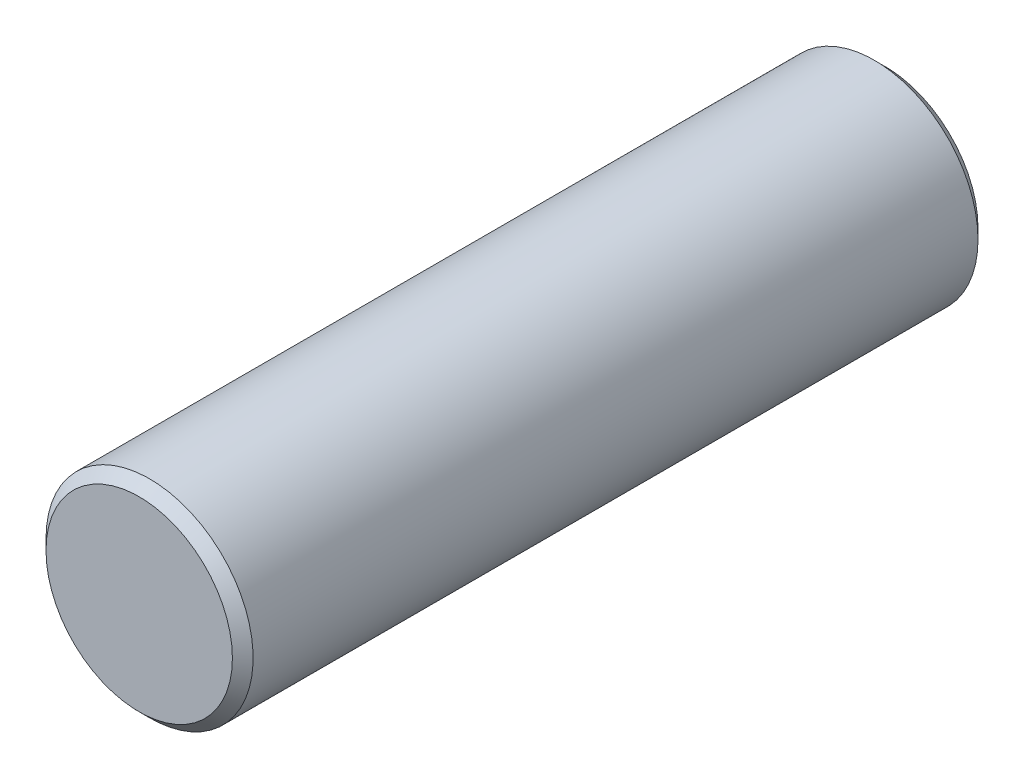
ISO-10303-21;
HEADER;
FILE_DESCRIPTION(('STEP AP214'),'2;1');
FILE_NAME('part.step','',(''),(''),'','','');
FILE_SCHEMA(('AUTOMOTIVE_DESIGN { 1 0 10303 214 1 1 1 1 }'));
ENDSEC;
DATA;
#1=APPLICATION_CONTEXT('core data for automotive mechanical design processes');
#2=APPLICATION_PROTOCOL_DEFINITION('international standard','automotive_design',2000,#1);
#3=PRODUCT_CONTEXT('',#1,'mechanical');
#4=PRODUCT('Part','Part','',(#3));
#5=PRODUCT_RELATED_PRODUCT_CATEGORY('part','',(#4));
#6=PRODUCT_DEFINITION_FORMATION('','',#4);
#7=PRODUCT_DEFINITION_CONTEXT('part definition',#1,'design');
#8=PRODUCT_DEFINITION('design','',#6,#7);
#9=PRODUCT_DEFINITION_SHAPE('','',#8);
#10=(LENGTH_UNIT() NAMED_UNIT(*) SI_UNIT(.MILLI.,.METRE.));
#11=(NAMED_UNIT(*) PLANE_ANGLE_UNIT() SI_UNIT($,.RADIAN.));
#12=(NAMED_UNIT(*) SI_UNIT($,.STERADIAN.) SOLID_ANGLE_UNIT());
#13=UNCERTAINTY_MEASURE_WITH_UNIT(LENGTH_MEASURE(1.E-05),#10,'distance_accuracy_value','');
#14=(GEOMETRIC_REPRESENTATION_CONTEXT(3) GLOBAL_UNCERTAINTY_ASSIGNED_CONTEXT((#13)) GLOBAL_UNIT_ASSIGNED_CONTEXT((#10,
#11,#12)) REPRESENTATION_CONTEXT('',''));
#15=CARTESIAN_POINT('',(0.,0.,0.));
#16=DIRECTION('',(0.,0.,1.));
#17=DIRECTION('',(1.,0.,0.));
#18=AXIS2_PLACEMENT_3D('',#15,#16,#17);
#19=CARTESIAN_POINT('',(0.,0.,3.6));
#20=DIRECTION('',(0.,0.,-1.));
#21=DIRECTION('',(-1.,0.,0.));
#22=AXIS2_PLACEMENT_3D('',#19,#20,#21);
#23=CYLINDRICAL_SURFACE('',#22,1.);
#24=CARTESIAN_POINT('',(0.,0.,-3.5));
#25=DIRECTION('',(0.,0.,1.));
#26=DIRECTION('',(1.,0.,0.));
#27=AXIS2_PLACEMENT_3D('',#24,#25,#26);
#28=CIRCLE('',#27,1.);
#29=CARTESIAN_POINT('',(1.,0.,-3.5));
#30=VERTEX_POINT('',#29);
#31=EDGE_CURVE('E43',#30,#30,#28,.T.);
#32=ORIENTED_EDGE('',*,*,#31,.T.);
#33=EDGE_LOOP('',(#32));
#34=FACE_BOUND('',#33,.T.);
#35=CARTESIAN_POINT('',(0.,0.,3.5));
#36=DIRECTION('',(0.,0.,1.));
#37=DIRECTION('',(1.,0.,0.));
#38=AXIS2_PLACEMENT_3D('',#35,#36,#37);
#39=CIRCLE('',#38,1.);
#40=CARTESIAN_POINT('',(-1.,0.,3.5));
#41=VERTEX_POINT('',#40);
#42=EDGE_CURVE('E47',#41,#41,#39,.F.);
#43=ORIENTED_EDGE('',*,*,#42,.T.);
#44=EDGE_LOOP('',(#43));
#45=FACE_BOUND('',#44,.T.);
#46=ADVANCED_FACE('F32',(#34,#45),#23,.T.);
#47=CARTESIAN_POINT('',(0.,0.,3.6));
#48=DIRECTION('',(0.,0.,1.));
#49=DIRECTION('',(1.,0.,0.));
#50=AXIS2_PLACEMENT_3D('',#47,#48,#49);
#51=PLANE('',#50);
#52=CARTESIAN_POINT('',(0.,0.,3.6));
#53=DIRECTION('',(0.,0.,1.));
#54=DIRECTION('',(1.,0.,0.));
#55=AXIS2_PLACEMENT_3D('',#52,#53,#54);
#56=CIRCLE('',#55,0.900000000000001);
#57=CARTESIAN_POINT('',(-0.900000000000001,0.,3.6));
#58=VERTEX_POINT('',#57);
#59=EDGE_CURVE('E10',#58,#58,#56,.T.);
#60=ORIENTED_EDGE('',*,*,#59,.T.);
#61=EDGE_LOOP('',(#60));
#62=FACE_BOUND('',#61,.T.);
#63=ADVANCED_FACE('F63',(#62),#51,.T.);
#64=CARTESIAN_POINT('',(0.,0.,-3.6));
#65=DIRECTION('',(0.,0.,1.));
#66=DIRECTION('',(1.,0.,0.));
#67=AXIS2_PLACEMENT_3D('',#64,#65,#66);
#68=PLANE('',#67);
#69=CARTESIAN_POINT('',(0.,0.,-3.6));
#70=DIRECTION('',(0.,0.,1.));
#71=DIRECTION('',(1.,0.,0.));
#72=AXIS2_PLACEMENT_3D('',#69,#70,#71);
#73=CIRCLE('',#72,0.899999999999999);
#74=CARTESIAN_POINT('',(0.899999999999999,0.,-3.6));
#75=VERTEX_POINT('',#74);
#76=EDGE_CURVE('E39',#75,#75,#73,.F.);
#77=ORIENTED_EDGE('',*,*,#76,.T.);
#78=EDGE_LOOP('',(#77));
#79=FACE_BOUND('',#78,.T.);
#80=ADVANCED_FACE('F60',(#79),#68,.F.);
#81=CARTESIAN_POINT('',(0.,0.,-3.5));
#82=DIRECTION('',(0.,0.,1.));
#83=DIRECTION('',(1.,0.,0.));
#84=AXIS2_PLACEMENT_3D('',#81,#82,#83);
#85=CONICAL_SURFACE('',#84,1.,0.785398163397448);
#86=ORIENTED_EDGE('',*,*,#76,.F.);
#87=EDGE_LOOP('',(#86));
#88=FACE_BOUND('',#87,.T.);
#89=ORIENTED_EDGE('',*,*,#31,.F.);
#90=EDGE_LOOP('',(#89));
#91=FACE_BOUND('',#90,.T.);
#92=ADVANCED_FACE('F56',(#88,#91),#85,.T.);
#93=CARTESIAN_POINT('',(0.,0.,3.6));
#94=DIRECTION('',(0.,0.,-1.));
#95=DIRECTION('',(-1.,0.,0.));
#96=AXIS2_PLACEMENT_3D('',#93,#94,#95);
#97=CONICAL_SURFACE('',#96,0.900000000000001,0.785398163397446);
#98=CARTESIAN_POINT('',(-1.,0.,3.5));
#99=CARTESIAN_POINT('',(-0.998958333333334,0.,3.50104166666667));
#100=CARTESIAN_POINT('',(-0.997916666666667,0.,3.50208333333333));
#101=CARTESIAN_POINT('',(-0.995833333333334,0.,3.50416666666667));
#102=CARTESIAN_POINT('',(-0.994791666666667,0.,3.50520833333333));
#103=CARTESIAN_POINT('',(-0.992708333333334,0.,3.50729166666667));
#104=CARTESIAN_POINT('',(-0.991666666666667,0.,3.50833333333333));
#105=CARTESIAN_POINT('',(-0.989583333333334,0.,3.51041666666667));
#106=CARTESIAN_POINT('',(-0.988541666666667,0.,3.51145833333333));
#107=CARTESIAN_POINT('',(-0.986458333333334,0.,3.51354166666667));
#108=CARTESIAN_POINT('',(-0.985416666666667,0.,3.51458333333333));
#109=CARTESIAN_POINT('',(-0.983333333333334,0.,3.51666666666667));
#110=CARTESIAN_POINT('',(-0.982291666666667,0.,3.51770833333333));
#111=CARTESIAN_POINT('',(-0.980208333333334,0.,3.51979166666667));
#112=CARTESIAN_POINT('',(-0.979166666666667,0.,3.52083333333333));
#113=CARTESIAN_POINT('',(-0.977083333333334,0.,3.52291666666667));
#114=CARTESIAN_POINT('',(-0.976041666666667,0.,3.52395833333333));
#115=CARTESIAN_POINT('',(-0.973958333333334,0.,3.52604166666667));
#116=CARTESIAN_POINT('',(-0.972916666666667,0.,3.52708333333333));
#117=CARTESIAN_POINT('',(-0.970833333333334,0.,3.52916666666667));
#118=CARTESIAN_POINT('',(-0.969791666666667,0.,3.53020833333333));
#119=CARTESIAN_POINT('',(-0.967708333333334,0.,3.53229166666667));
#120=CARTESIAN_POINT('',(-0.966666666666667,0.,3.53333333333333));
#121=CARTESIAN_POINT('',(-0.964583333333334,0.,3.53541666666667));
#122=CARTESIAN_POINT('',(-0.963541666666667,0.,3.53645833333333));
#123=CARTESIAN_POINT('',(-0.961458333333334,0.,3.53854166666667));
#124=CARTESIAN_POINT('',(-0.960416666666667,0.,3.53958333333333));
#125=CARTESIAN_POINT('',(-0.958333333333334,0.,3.54166666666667));
#126=CARTESIAN_POINT('',(-0.957291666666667,0.,3.54270833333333));
#127=CARTESIAN_POINT('',(-0.955208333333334,0.,3.54479166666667));
#128=CARTESIAN_POINT('',(-0.954166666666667,0.,3.54583333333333));
#129=CARTESIAN_POINT('',(-0.952083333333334,0.,3.54791666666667));
#130=CARTESIAN_POINT('',(-0.951041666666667,0.,3.54895833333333));
#131=CARTESIAN_POINT('',(-0.948958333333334,0.,3.55104166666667));
#132=CARTESIAN_POINT('',(-0.947916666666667,0.,3.55208333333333));
#133=CARTESIAN_POINT('',(-0.945833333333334,0.,3.55416666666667));
#134=CARTESIAN_POINT('',(-0.944791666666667,0.,3.55520833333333));
#135=CARTESIAN_POINT('',(-0.942708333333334,0.,3.55729166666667));
#136=CARTESIAN_POINT('',(-0.941666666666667,0.,3.55833333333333));
#137=CARTESIAN_POINT('',(-0.939583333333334,0.,3.56041666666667));
#138=CARTESIAN_POINT('',(-0.938541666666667,0.,3.56145833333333));
#139=CARTESIAN_POINT('',(-0.936458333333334,0.,3.56354166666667));
#140=CARTESIAN_POINT('',(-0.935416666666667,0.,3.56458333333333));
#141=CARTESIAN_POINT('',(-0.933333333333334,0.,3.56666666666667));
#142=CARTESIAN_POINT('',(-0.932291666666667,0.,3.56770833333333));
#143=CARTESIAN_POINT('',(-0.930208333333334,0.,3.56979166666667));
#144=CARTESIAN_POINT('',(-0.929166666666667,0.,3.57083333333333));
#145=CARTESIAN_POINT('',(-0.927083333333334,0.,3.57291666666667));
#146=CARTESIAN_POINT('',(-0.926041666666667,0.,3.57395833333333));
#147=CARTESIAN_POINT('',(-0.923958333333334,0.,3.57604166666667));
#148=CARTESIAN_POINT('',(-0.922916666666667,0.,3.57708333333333));
#149=CARTESIAN_POINT('',(-0.920833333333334,0.,3.57916666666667));
#150=CARTESIAN_POINT('',(-0.919791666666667,0.,3.58020833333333));
#151=CARTESIAN_POINT('',(-0.917708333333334,0.,3.58229166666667));
#152=CARTESIAN_POINT('',(-0.916666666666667,0.,3.58333333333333));
#153=CARTESIAN_POINT('',(-0.914583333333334,0.,3.58541666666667));
#154=CARTESIAN_POINT('',(-0.913541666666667,0.,3.58645833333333));
#155=CARTESIAN_POINT('',(-0.911458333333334,0.,3.58854166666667));
#156=CARTESIAN_POINT('',(-0.910416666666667,0.,3.58958333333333));
#157=CARTESIAN_POINT('',(-0.908333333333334,0.,3.59166666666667));
#158=CARTESIAN_POINT('',(-0.907291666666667,0.,3.59270833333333));
#159=CARTESIAN_POINT('',(-0.905208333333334,0.,3.59479166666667));
#160=CARTESIAN_POINT('',(-0.904166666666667,0.,3.59583333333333));
#161=CARTESIAN_POINT('',(-0.902083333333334,0.,3.59791666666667));
#162=CARTESIAN_POINT('',(-0.901041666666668,0.,3.59895833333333));
#163=CARTESIAN_POINT('',(-0.900000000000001,0.,3.6));
#164=B_SPLINE_CURVE_WITH_KNOTS('',3,(#98,#99,#100,#101,#102,#103,#104,#105,#106,#107,#108,#109,
#110,#111,#112,#113,#114,#115,#116,#117,#118,#119,#120,#121,#122,#123,#124,#125,#126,#127,#128,
#129,#130,#131,#132,#133,#134,#135,#136,#137,#138,#139,#140,#141,#142,#143,#144,#145,#146,#147,
#148,#149,#150,#151,#152,#153,#154,#155,#156,#157,#158,#159,#160,#161,#162,#163),.UNSPECIFIED.,
.F.,.F.,(4,2,2,2,2,2,2,2,2,2,2,2,2,2,2,2,2,2,2,2,2,2,2,2,2,2,2,2,2,2,2,2,4),(0.,
0.00441941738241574,0.00883883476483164,0.0132582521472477,0.0176776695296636,
0.0220970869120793,0.0265165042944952,0.0309359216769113,0.0353553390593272,0.0397747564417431,
0.0441941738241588,0.0486135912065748,0.0530330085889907,0.0574524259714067,0.0618718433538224,
0.0662912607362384,0.0707106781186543,0.0751300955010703,0.0795495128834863,0.0839689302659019,
0.0883883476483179,0.0928077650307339,0.0972271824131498,0.101646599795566,0.106066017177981,
0.110485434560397,0.114904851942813,0.119324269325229,0.123743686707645,0.128163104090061,
0.132582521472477,0.137001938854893,0.141421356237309),.UNSPECIFIED.);
#165=EDGE_CURVE('BSEAM34',#41,#58,#164,.T.);
#166=ORIENTED_EDGE('',*,*,#42,.F.);
#167=ORIENTED_EDGE('',*,*,#59,.F.);
#168=ORIENTED_EDGE('',*,*,#165,.T.);
#169=ORIENTED_EDGE('',*,*,#165,.F.);
#170=EDGE_LOOP('',(#166,#168,#167,#169));
#171=FACE_BOUND('',#170,.T.);
#172=ADVANCED_FACE('F34',(#171),#97,.T.);
#173=CLOSED_SHELL('',(#46,#63,#80,#92,#172));
#174=MANIFOLD_SOLID_BREP('B2',#173);
#175=ADVANCED_BREP_SHAPE_REPRESENTATION('',(#18,#174),#14);
#176=SHAPE_DEFINITION_REPRESENTATION(#9,#175);
ENDSEC;
END-ISO-10303-21;
